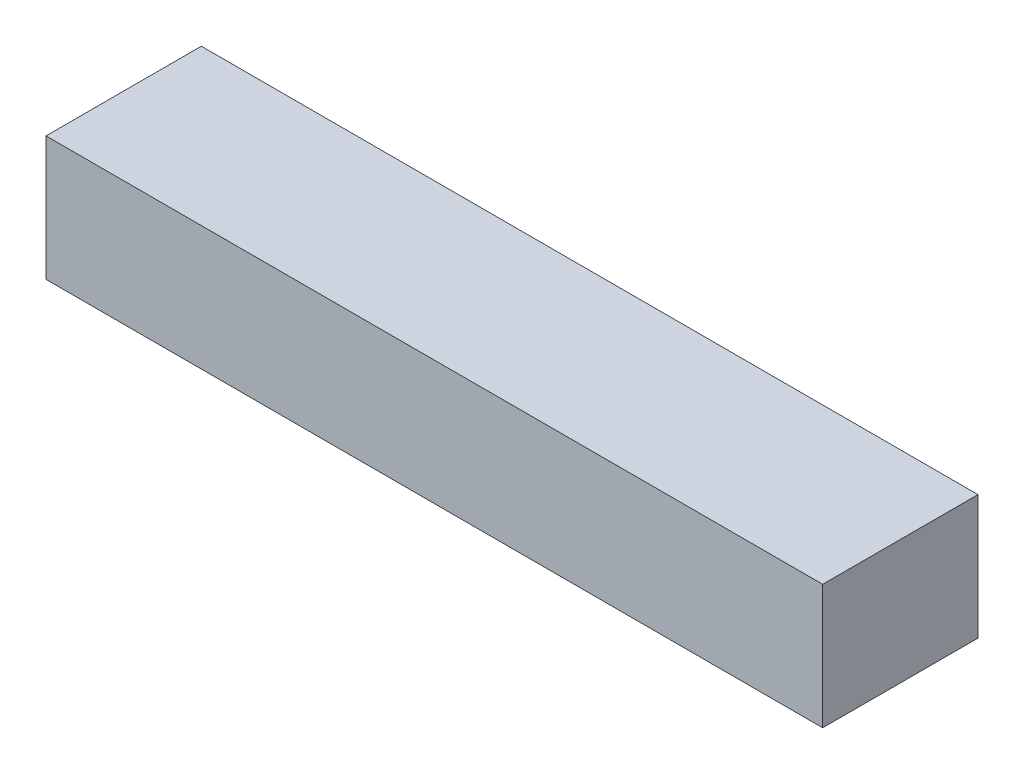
ISO-10303-21;
HEADER;
FILE_DESCRIPTION(('STEP AP214'),'2;1');
FILE_NAME('part.step','',(''),(''),'','','');
FILE_SCHEMA(('AUTOMOTIVE_DESIGN { 1 0 10303 214 1 1 1 1 }'));
ENDSEC;
DATA;
#1=APPLICATION_CONTEXT('core data for automotive mechanical design processes');
#2=APPLICATION_PROTOCOL_DEFINITION('international standard','automotive_design',2000,#1);
#3=PRODUCT_CONTEXT('',#1,'mechanical');
#4=PRODUCT('Part','Part','',(#3));
#5=PRODUCT_RELATED_PRODUCT_CATEGORY('part','',(#4));
#6=PRODUCT_DEFINITION_FORMATION('','',#4);
#7=PRODUCT_DEFINITION_CONTEXT('part definition',#1,'design');
#8=PRODUCT_DEFINITION('design','',#6,#7);
#9=PRODUCT_DEFINITION_SHAPE('','',#8);
#10=(LENGTH_UNIT() NAMED_UNIT(*) SI_UNIT(.MILLI.,.METRE.));
#11=(NAMED_UNIT(*) PLANE_ANGLE_UNIT() SI_UNIT($,.RADIAN.));
#12=(NAMED_UNIT(*) SI_UNIT($,.STERADIAN.) SOLID_ANGLE_UNIT());
#13=UNCERTAINTY_MEASURE_WITH_UNIT(LENGTH_MEASURE(1.E-05),#10,'distance_accuracy_value','');
#14=(GEOMETRIC_REPRESENTATION_CONTEXT(3) GLOBAL_UNCERTAINTY_ASSIGNED_CONTEXT((#13)) GLOBAL_UNIT_ASSIGNED_CONTEXT((#10,
#11,#12)) REPRESENTATION_CONTEXT('',''));
#15=CARTESIAN_POINT('',(0.,0.,0.));
#16=DIRECTION('',(0.,0.,1.));
#17=DIRECTION('',(1.,0.,0.));
#18=AXIS2_PLACEMENT_3D('',#15,#16,#17);
#19=CARTESIAN_POINT('',(25.,4.,10.));
#20=DIRECTION('',(-1.,0.,0.));
#21=DIRECTION('',(0.,0.,1.));
#22=AXIS2_PLACEMENT_3D('',#19,#20,#21);
#23=PLANE('',#22);
#24=DIRECTION('',(0.,1.,0.));
#25=VECTOR('',#24,1.);
#26=CARTESIAN_POINT('',(25.,4.,0.));
#27=LINE('',#26,#25);
#28=CARTESIAN_POINT('',(25.,-4.,0.));
#29=VERTEX_POINT('',#28);
#30=CARTESIAN_POINT('',(25.,4.,0.));
#31=VERTEX_POINT('',#30);
#32=EDGE_CURVE('E111',#29,#31,#27,.T.);
#33=ORIENTED_EDGE('',*,*,#32,.T.);
#34=DIRECTION('',(0.,0.,-1.));
#35=VECTOR('',#34,1.);
#36=CARTESIAN_POINT('',(25.,4.,10.));
#37=LINE('',#36,#35);
#38=CARTESIAN_POINT('',(25.,4.,10.));
#39=VERTEX_POINT('',#38);
#40=EDGE_CURVE('E11',#39,#31,#37,.T.);
#41=ORIENTED_EDGE('',*,*,#40,.F.);
#42=DIRECTION('',(0.,1.,0.));
#43=VECTOR('',#42,1.);
#44=CARTESIAN_POINT('',(25.,4.,10.));
#45=LINE('',#44,#43);
#46=CARTESIAN_POINT('',(25.,-4.,10.));
#47=VERTEX_POINT('',#46);
#48=EDGE_CURVE('E95',#47,#39,#45,.T.);
#49=ORIENTED_EDGE('',*,*,#48,.F.);
#50=DIRECTION('',(0.,0.,-1.));
#51=VECTOR('',#50,1.);
#52=CARTESIAN_POINT('',(25.,-4.,10.));
#53=LINE('',#52,#51);
#54=EDGE_CURVE('E107',#47,#29,#53,.T.);
#55=ORIENTED_EDGE('',*,*,#54,.T.);
#56=EDGE_LOOP('',(#33,#41,#49,#55));
#57=FACE_BOUND('',#56,.T.);
#58=ADVANCED_FACE('F43',(#57),#23,.F.);
#59=CARTESIAN_POINT('',(-25.,4.,10.));
#60=DIRECTION('',(0.,-1.,0.));
#61=DIRECTION('',(0.,0.,-1.));
#62=AXIS2_PLACEMENT_3D('',#59,#60,#61);
#63=PLANE('',#62);
#64=DIRECTION('',(-1.,0.,0.));
#65=VECTOR('',#64,1.);
#66=CARTESIAN_POINT('',(-25.,4.,0.));
#67=LINE('',#66,#65);
#68=CARTESIAN_POINT('',(-25.,4.,0.));
#69=VERTEX_POINT('',#68);
#70=EDGE_CURVE('E100',#31,#69,#67,.T.);
#71=ORIENTED_EDGE('',*,*,#70,.T.);
#72=DIRECTION('',(0.,0.,-1.));
#73=VECTOR('',#72,1.);
#74=CARTESIAN_POINT('',(-25.,4.,10.));
#75=LINE('',#74,#73);
#76=CARTESIAN_POINT('',(-25.,4.,10.));
#77=VERTEX_POINT('',#76);
#78=EDGE_CURVE('E52',#77,#69,#75,.T.);
#79=ORIENTED_EDGE('',*,*,#78,.F.);
#80=DIRECTION('',(-1.,0.,0.));
#81=VECTOR('',#80,1.);
#82=CARTESIAN_POINT('',(-25.,4.,10.));
#83=LINE('',#82,#81);
#84=EDGE_CURVE('E90',#39,#77,#83,.T.);
#85=ORIENTED_EDGE('',*,*,#84,.F.);
#86=ORIENTED_EDGE('',*,*,#40,.T.);
#87=EDGE_LOOP('',(#71,#79,#85,#86));
#88=FACE_BOUND('',#87,.T.);
#89=ADVANCED_FACE('F99',(#88),#63,.F.);
#90=CARTESIAN_POINT('',(-25.,4.,10.));
#91=DIRECTION('',(1.,0.,0.));
#92=DIRECTION('',(0.,0.,-1.));
#93=AXIS2_PLACEMENT_3D('',#90,#91,#92);
#94=PLANE('',#93);
#95=DIRECTION('',(0.,-1.,0.));
#96=VECTOR('',#95,1.);
#97=CARTESIAN_POINT('',(-25.,4.,0.));
#98=LINE('',#97,#96);
#99=CARTESIAN_POINT('',(-25.,-4.,0.));
#100=VERTEX_POINT('',#99);
#101=EDGE_CURVE('E77',#69,#100,#98,.T.);
#102=ORIENTED_EDGE('',*,*,#101,.T.);
#103=DIRECTION('',(0.,0.,-1.));
#104=VECTOR('',#103,1.);
#105=CARTESIAN_POINT('',(-25.,-4.,10.));
#106=LINE('',#105,#104);
#107=CARTESIAN_POINT('',(-25.,-4.,10.));
#108=VERTEX_POINT('',#107);
#109=EDGE_CURVE('E102',#108,#100,#106,.T.);
#110=ORIENTED_EDGE('',*,*,#109,.F.);
#111=DIRECTION('',(0.,-1.,0.));
#112=VECTOR('',#111,1.);
#113=CARTESIAN_POINT('',(-25.,4.,10.));
#114=LINE('',#113,#112);
#115=EDGE_CURVE('E93',#77,#108,#114,.T.);
#116=ORIENTED_EDGE('',*,*,#115,.F.);
#117=ORIENTED_EDGE('',*,*,#78,.T.);
#118=EDGE_LOOP('',(#102,#110,#116,#117));
#119=FACE_BOUND('',#118,.T.);
#120=ADVANCED_FACE('F103',(#119),#94,.F.);
#121=CARTESIAN_POINT('',(-25.,-4.,10.));
#122=DIRECTION('',(0.,1.,0.));
#123=DIRECTION('',(0.,0.,1.));
#124=AXIS2_PLACEMENT_3D('',#121,#122,#123);
#125=PLANE('',#124);
#126=DIRECTION('',(1.,0.,0.));
#127=VECTOR('',#126,1.);
#128=CARTESIAN_POINT('',(-25.,-4.,0.));
#129=LINE('',#128,#127);
#130=EDGE_CURVE('E83',#100,#29,#129,.T.);
#131=ORIENTED_EDGE('',*,*,#130,.T.);
#132=ORIENTED_EDGE('',*,*,#54,.F.);
#133=DIRECTION('',(1.,0.,0.));
#134=VECTOR('',#133,1.);
#135=CARTESIAN_POINT('',(-25.,-4.,10.));
#136=LINE('',#135,#134);
#137=EDGE_CURVE('E60',#108,#47,#136,.T.);
#138=ORIENTED_EDGE('',*,*,#137,.F.);
#139=ORIENTED_EDGE('',*,*,#109,.T.);
#140=EDGE_LOOP('',(#131,#132,#138,#139));
#141=FACE_BOUND('',#140,.T.);
#142=ADVANCED_FACE('F124',(#141),#125,.F.);
#143=CARTESIAN_POINT('',(0.,0.,10.));
#144=DIRECTION('',(0.,0.,1.));
#145=DIRECTION('',(1.,0.,0.));
#146=AXIS2_PLACEMENT_3D('',#143,#144,#145);
#147=PLANE('',#146);
#148=ORIENTED_EDGE('',*,*,#48,.T.);
#149=ORIENTED_EDGE('',*,*,#84,.T.);
#150=ORIENTED_EDGE('',*,*,#115,.T.);
#151=ORIENTED_EDGE('',*,*,#137,.T.);
#152=EDGE_LOOP('',(#148,#149,#150,#151));
#153=FACE_BOUND('',#152,.T.);
#154=ADVANCED_FACE('F91',(#153),#147,.T.);
#155=CARTESIAN_POINT('',(0.,0.,0.));
#156=DIRECTION('',(0.,0.,1.));
#157=DIRECTION('',(1.,0.,0.));
#158=AXIS2_PLACEMENT_3D('',#155,#156,#157);
#159=PLANE('',#158);
#160=ORIENTED_EDGE('',*,*,#32,.F.);
#161=ORIENTED_EDGE('',*,*,#130,.F.);
#162=ORIENTED_EDGE('',*,*,#101,.F.);
#163=ORIENTED_EDGE('',*,*,#70,.F.);
#164=EDGE_LOOP('',(#160,#161,#162,#163));
#165=FACE_BOUND('',#164,.T.);
#166=ADVANCED_FACE('F127',(#165),#159,.F.);
#167=CLOSED_SHELL('',(#58,#89,#120,#142,#154,#166));
#168=MANIFOLD_SOLID_BREP('B2',#167);
#169=ADVANCED_BREP_SHAPE_REPRESENTATION('',(#18,#168),#14);
#170=SHAPE_DEFINITION_REPRESENTATION(#9,#169);
ENDSEC;
END-ISO-10303-21;
